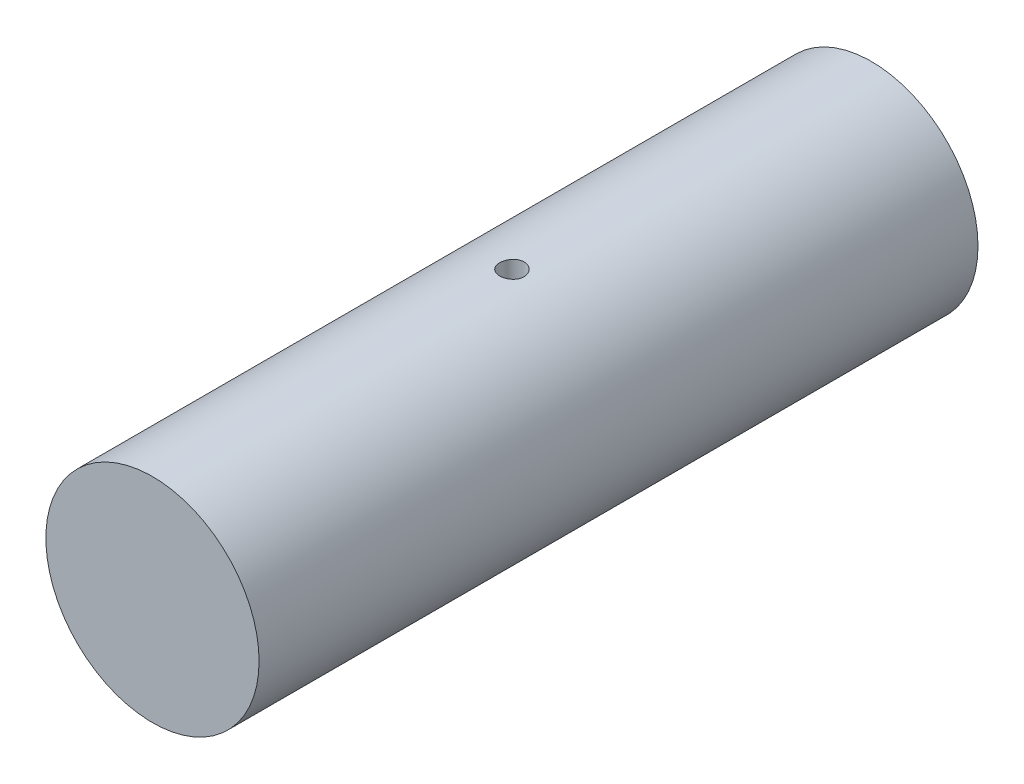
from build123d import *

# Parameters (mm, degrees)
ESQUISSE1_R                  = 17.5
BOSS_EXTRU_1_DEPTH           = 118
ENL_V_MAT_EXTRU_1_DEPTH      = 121.567408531
ENL_V_MAT_EXTRU_1_DEPTH_BACK = 121.567408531
ESQUISSE2_R                  = 2


with BuildPart() as part:
    # Esquisse1 → Boss.-Extru.1 (new body)
    with BuildSketch(Plane.XY):
        Circle(ESQUISSE1_R)
    extrude(amount=BOSS_EXTRU_1_DEPTH)

    # Esquisse2 → Enl_v. mat.-Extru.1 (cut, two sides: drawn at the far end of the back side and taken through both)
    with BuildSketch(Plane(origin=(0, 0, 0), x_dir=(1, 0, 0), z_dir=(0, 1, 0)).offset(-ENL_V_MAT_EXTRU_1_DEPTH_BACK)):
        with Locations(Location((0, -59, 0), (0, 0, 270))):
            Circle(ESQUISSE2_R)
    extrude(amount=ENL_V_MAT_EXTRU_1_DEPTH + ENL_V_MAT_EXTRU_1_DEPTH_BACK, mode=Mode.SUBTRACT)


solid = part.part
